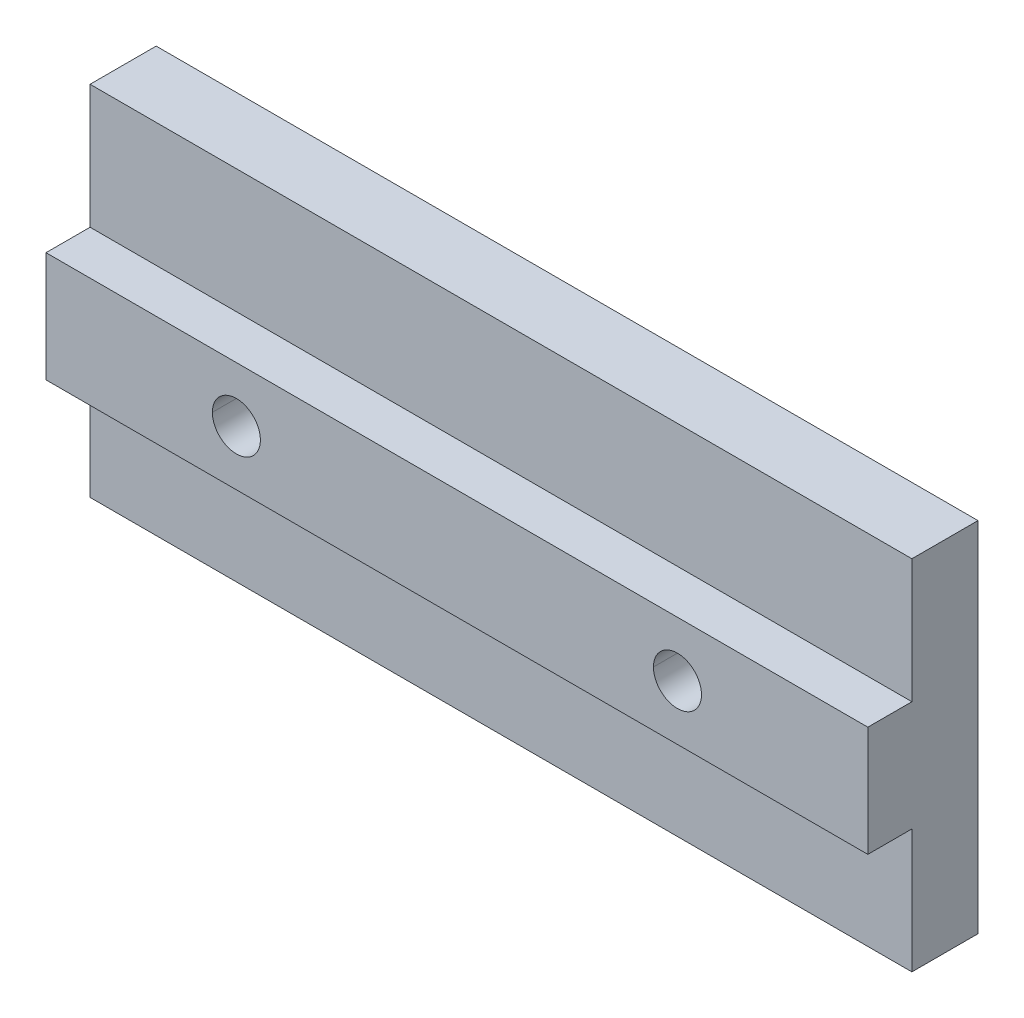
ISO-10303-21;
HEADER;
FILE_DESCRIPTION(('STEP AP214'),'2;1');
FILE_NAME('part.step','',(''),(''),'','','');
FILE_SCHEMA(('AUTOMOTIVE_DESIGN { 1 0 10303 214 1 1 1 1 }'));
ENDSEC;
DATA;
#1=APPLICATION_CONTEXT('core data for automotive mechanical design processes');
#2=APPLICATION_PROTOCOL_DEFINITION('international standard','automotive_design',2000,#1);
#3=PRODUCT_CONTEXT('',#1,'mechanical');
#4=PRODUCT('Part','Part','',(#3));
#5=PRODUCT_RELATED_PRODUCT_CATEGORY('part','',(#4));
#6=PRODUCT_DEFINITION_FORMATION('','',#4);
#7=PRODUCT_DEFINITION_CONTEXT('part definition',#1,'design');
#8=PRODUCT_DEFINITION('design','',#6,#7);
#9=PRODUCT_DEFINITION_SHAPE('','',#8);
#10=(LENGTH_UNIT() NAMED_UNIT(*) SI_UNIT(.MILLI.,.METRE.));
#11=(NAMED_UNIT(*) PLANE_ANGLE_UNIT() SI_UNIT($,.RADIAN.));
#12=(NAMED_UNIT(*) SI_UNIT($,.STERADIAN.) SOLID_ANGLE_UNIT());
#13=UNCERTAINTY_MEASURE_WITH_UNIT(LENGTH_MEASURE(1.E-05),#10,'distance_accuracy_value','');
#14=(GEOMETRIC_REPRESENTATION_CONTEXT(3) GLOBAL_UNCERTAINTY_ASSIGNED_CONTEXT((#13)) GLOBAL_UNIT_ASSIGNED_CONTEXT((#10,
#11,#12)) REPRESENTATION_CONTEXT('',''));
#15=CARTESIAN_POINT('',(0.,0.,0.));
#16=DIRECTION('',(0.,0.,1.));
#17=DIRECTION('',(1.,0.,0.));
#18=AXIS2_PLACEMENT_3D('',#15,#16,#17);
#19=CARTESIAN_POINT('',(23.6855,-10.3124,-3.81));
#20=DIRECTION('',(0.,0.,1.));
#21=DIRECTION('',(1.,0.,0.));
#22=AXIS2_PLACEMENT_3D('',#19,#20,#21);
#23=PLANE('',#22);
#24=CARTESIAN_POINT('',(12.7127,0.,-3.81));
#25=DIRECTION('',(0.,0.,-1.));
#26=DIRECTION('',(-1.,0.,0.));
#27=AXIS2_PLACEMENT_3D('',#24,#25,#26);
#28=CIRCLE('',#27,1.3843);
#29=CARTESIAN_POINT('',(11.3284,0.,-3.81));
#30=VERTEX_POINT('',#29);
#31=CARTESIAN_POINT('',(14.097,0.,-3.81));
#32=VERTEX_POINT('',#31);
#33=EDGE_CURVE('E11',#30,#32,#28,.T.);
#34=ORIENTED_EDGE('',*,*,#33,.F.);
#35=CARTESIAN_POINT('',(12.7127,0.,-3.81));
#36=DIRECTION('',(0.,0.,-1.));
#37=DIRECTION('',(-1.,0.,0.));
#38=AXIS2_PLACEMENT_3D('',#35,#36,#37);
#39=CIRCLE('',#38,1.3843);
#40=EDGE_CURVE('E25',#32,#30,#39,.T.);
#41=ORIENTED_EDGE('',*,*,#40,.F.);
#42=EDGE_LOOP('',(#34,#41));
#43=FACE_BOUND('',#42,.T.);
#44=CARTESIAN_POINT('',(-12.7127,0.,-3.81));
#45=DIRECTION('',(0.,0.,-1.));
#46=DIRECTION('',(-1.,0.,0.));
#47=AXIS2_PLACEMENT_3D('',#44,#45,#46);
#48=CIRCLE('',#47,1.3843);
#49=CARTESIAN_POINT('',(-14.097,0.,-3.81));
#50=VERTEX_POINT('',#49);
#51=CARTESIAN_POINT('',(-11.3284,0.,-3.81));
#52=VERTEX_POINT('',#51);
#53=EDGE_CURVE('E237',#50,#52,#48,.T.);
#54=ORIENTED_EDGE('',*,*,#53,.F.);
#55=CARTESIAN_POINT('',(-12.7127,0.,-3.81));
#56=DIRECTION('',(0.,0.,-1.));
#57=DIRECTION('',(-1.,0.,0.));
#58=AXIS2_PLACEMENT_3D('',#55,#56,#57);
#59=CIRCLE('',#58,1.3843);
#60=EDGE_CURVE('E232',#52,#50,#59,.T.);
#61=ORIENTED_EDGE('',*,*,#60,.F.);
#62=EDGE_LOOP('',(#54,#61));
#63=FACE_BOUND('',#62,.T.);
#64=DIRECTION('',(0.,1.,0.));
#65=VECTOR('',#64,1.);
#66=CARTESIAN_POINT('',(-23.6855,-10.3124,-3.81));
#67=LINE('',#66,#65);
#68=CARTESIAN_POINT('',(-23.6855,-10.3124,-3.81));
#69=VERTEX_POINT('',#68);
#70=CARTESIAN_POINT('',(-23.6855,10.3124,-3.81));
#71=VERTEX_POINT('',#70);
#72=EDGE_CURVE('E228',#69,#71,#67,.T.);
#73=ORIENTED_EDGE('',*,*,#72,.T.);
#74=DIRECTION('',(-1.,0.,0.));
#75=VECTOR('',#74,1.);
#76=CARTESIAN_POINT('',(23.6855,10.3124,-3.81));
#77=LINE('',#76,#75);
#78=CARTESIAN_POINT('',(23.6855,10.3124,-3.81));
#79=VERTEX_POINT('',#78);
#80=EDGE_CURVE('E118',#79,#71,#77,.T.);
#81=ORIENTED_EDGE('',*,*,#80,.F.);
#82=DIRECTION('',(0.,1.,0.));
#83=VECTOR('',#82,1.);
#84=CARTESIAN_POINT('',(23.6855,-10.3124,-3.81));
#85=LINE('',#84,#83);
#86=CARTESIAN_POINT('',(23.6855,-10.3124,-3.81));
#87=VERTEX_POINT('',#86);
#88=EDGE_CURVE('E220',#87,#79,#85,.T.);
#89=ORIENTED_EDGE('',*,*,#88,.F.);
#90=DIRECTION('',(-1.,0.,0.));
#91=VECTOR('',#90,1.);
#92=CARTESIAN_POINT('',(23.6855,-10.3124,-3.81));
#93=LINE('',#92,#91);
#94=EDGE_CURVE('E216',#87,#69,#93,.T.);
#95=ORIENTED_EDGE('',*,*,#94,.T.);
#96=EDGE_LOOP('',(#73,#81,#89,#95));
#97=FACE_BOUND('',#96,.T.);
#98=ADVANCED_FACE('F17',(#43,#63,#97),#23,.F.);
#99=CARTESIAN_POINT('',(23.6855,-10.3124,0.));
#100=DIRECTION('',(0.,1.,0.));
#101=DIRECTION('',(0.,0.,1.));
#102=AXIS2_PLACEMENT_3D('',#99,#100,#101);
#103=PLANE('',#102);
#104=DIRECTION('',(0.,0.,-1.));
#105=VECTOR('',#104,1.);
#106=CARTESIAN_POINT('',(-23.6855,-10.3124,0.));
#107=LINE('',#106,#105);
#108=CARTESIAN_POINT('',(-23.6855,-10.3124,0.));
#109=VERTEX_POINT('',#108);
#110=EDGE_CURVE('E211',#109,#69,#107,.T.);
#111=ORIENTED_EDGE('',*,*,#110,.T.);
#112=ORIENTED_EDGE('',*,*,#94,.F.);
#113=DIRECTION('',(0.,0.,-1.));
#114=VECTOR('',#113,1.);
#115=CARTESIAN_POINT('',(23.6855,-10.3124,0.));
#116=LINE('',#115,#114);
#117=CARTESIAN_POINT('',(23.6855,-10.3124,0.));
#118=VERTEX_POINT('',#117);
#119=EDGE_CURVE('E206',#118,#87,#116,.T.);
#120=ORIENTED_EDGE('',*,*,#119,.F.);
#121=DIRECTION('',(-1.,0.,0.));
#122=VECTOR('',#121,1.);
#123=CARTESIAN_POINT('',(23.6855,-10.3124,0.));
#124=LINE('',#123,#122);
#125=EDGE_CURVE('E202',#118,#109,#124,.T.);
#126=ORIENTED_EDGE('',*,*,#125,.T.);
#127=EDGE_LOOP('',(#111,#112,#120,#126));
#128=FACE_BOUND('',#127,.T.);
#129=ADVANCED_FACE('F385',(#128),#103,.F.);
#130=CARTESIAN_POINT('',(23.6855,-3.175,0.));
#131=DIRECTION('',(0.,0.,-1.));
#132=DIRECTION('',(-1.,0.,0.));
#133=AXIS2_PLACEMENT_3D('',#130,#131,#132);
#134=PLANE('',#133);
#135=DIRECTION('',(0.,-1.,0.));
#136=VECTOR('',#135,1.);
#137=CARTESIAN_POINT('',(-23.6855,-3.175,0.));
#138=LINE('',#137,#136);
#139=CARTESIAN_POINT('',(-23.6855,-3.175,0.));
#140=VERTEX_POINT('',#139);
#141=EDGE_CURVE('E197',#140,#109,#138,.T.);
#142=ORIENTED_EDGE('',*,*,#141,.T.);
#143=ORIENTED_EDGE('',*,*,#125,.F.);
#144=DIRECTION('',(0.,-1.,0.));
#145=VECTOR('',#144,1.);
#146=CARTESIAN_POINT('',(23.6855,-3.175,0.));
#147=LINE('',#146,#145);
#148=CARTESIAN_POINT('',(23.6855,-3.175,0.));
#149=VERTEX_POINT('',#148);
#150=EDGE_CURVE('E192',#149,#118,#147,.T.);
#151=ORIENTED_EDGE('',*,*,#150,.F.);
#152=DIRECTION('',(-1.,0.,0.));
#153=VECTOR('',#152,1.);
#154=CARTESIAN_POINT('',(23.6855,-3.175,0.));
#155=LINE('',#154,#153);
#156=EDGE_CURVE('E188',#149,#140,#155,.T.);
#157=ORIENTED_EDGE('',*,*,#156,.T.);
#158=EDGE_LOOP('',(#142,#143,#151,#157));
#159=FACE_BOUND('',#158,.T.);
#160=ADVANCED_FACE('F389',(#159),#134,.F.);
#161=CARTESIAN_POINT('',(23.6855,-3.175,2.54));
#162=DIRECTION('',(0.,1.,0.));
#163=DIRECTION('',(0.,0.,1.));
#164=AXIS2_PLACEMENT_3D('',#161,#162,#163);
#165=PLANE('',#164);
#166=DIRECTION('',(0.,0.,-1.));
#167=VECTOR('',#166,1.);
#168=CARTESIAN_POINT('',(-23.6855,-3.175,2.54));
#169=LINE('',#168,#167);
#170=CARTESIAN_POINT('',(-23.6855,-3.175,2.54));
#171=VERTEX_POINT('',#170);
#172=EDGE_CURVE('E183',#171,#140,#169,.T.);
#173=ORIENTED_EDGE('',*,*,#172,.T.);
#174=ORIENTED_EDGE('',*,*,#156,.F.);
#175=DIRECTION('',(0.,0.,-1.));
#176=VECTOR('',#175,1.);
#177=CARTESIAN_POINT('',(23.6855,-3.175,2.54));
#178=LINE('',#177,#176);
#179=CARTESIAN_POINT('',(23.6855,-3.175,2.54));
#180=VERTEX_POINT('',#179);
#181=EDGE_CURVE('E178',#180,#149,#178,.T.);
#182=ORIENTED_EDGE('',*,*,#181,.F.);
#183=DIRECTION('',(-1.,0.,0.));
#184=VECTOR('',#183,1.);
#185=CARTESIAN_POINT('',(23.6855,-3.175,2.54));
#186=LINE('',#185,#184);
#187=EDGE_CURVE('E174',#180,#171,#186,.T.);
#188=ORIENTED_EDGE('',*,*,#187,.T.);
#189=EDGE_LOOP('',(#173,#174,#182,#188));
#190=FACE_BOUND('',#189,.T.);
#191=ADVANCED_FACE('F365',(#190),#165,.F.);
#192=CARTESIAN_POINT('',(23.6855,3.175,2.54));
#193=DIRECTION('',(0.,0.,-1.));
#194=DIRECTION('',(-1.,0.,0.));
#195=AXIS2_PLACEMENT_3D('',#192,#193,#194);
#196=PLANE('',#195);
#197=CARTESIAN_POINT('',(12.7127,0.,2.54));
#198=DIRECTION('',(0.,0.,-1.));
#199=DIRECTION('',(-1.,0.,0.));
#200=AXIS2_PLACEMENT_3D('',#197,#198,#199);
#201=CIRCLE('',#200,1.3843);
#202=CARTESIAN_POINT('',(11.3284,0.,2.54));
#203=VERTEX_POINT('',#202);
#204=CARTESIAN_POINT('',(14.097,0.,2.54));
#205=VERTEX_POINT('',#204);
#206=EDGE_CURVE('E170',#203,#205,#201,.T.);
#207=ORIENTED_EDGE('',*,*,#206,.T.);
#208=CARTESIAN_POINT('',(12.7127,0.,2.54));
#209=DIRECTION('',(0.,0.,-1.));
#210=DIRECTION('',(-1.,0.,0.));
#211=AXIS2_PLACEMENT_3D('',#208,#209,#210);
#212=CIRCLE('',#211,1.3843);
#213=EDGE_CURVE('E166',#205,#203,#212,.T.);
#214=ORIENTED_EDGE('',*,*,#213,.T.);
#215=EDGE_LOOP('',(#207,#214));
#216=FACE_BOUND('',#215,.T.);
#217=CARTESIAN_POINT('',(-12.7127,0.,2.54));
#218=DIRECTION('',(0.,0.,-1.));
#219=DIRECTION('',(-1.,0.,0.));
#220=AXIS2_PLACEMENT_3D('',#217,#218,#219);
#221=CIRCLE('',#220,1.3843);
#222=CARTESIAN_POINT('',(-14.097,0.,2.54));
#223=VERTEX_POINT('',#222);
#224=CARTESIAN_POINT('',(-11.3284,0.,2.54));
#225=VERTEX_POINT('',#224);
#226=EDGE_CURVE('E162',#223,#225,#221,.T.);
#227=ORIENTED_EDGE('',*,*,#226,.T.);
#228=CARTESIAN_POINT('',(-12.7127,0.,2.54));
#229=DIRECTION('',(0.,0.,-1.));
#230=DIRECTION('',(-1.,0.,0.));
#231=AXIS2_PLACEMENT_3D('',#228,#229,#230);
#232=CIRCLE('',#231,1.3843);
#233=EDGE_CURVE('E158',#225,#223,#232,.T.);
#234=ORIENTED_EDGE('',*,*,#233,.T.);
#235=EDGE_LOOP('',(#227,#234));
#236=FACE_BOUND('',#235,.T.);
#237=DIRECTION('',(0.,-1.,0.));
#238=VECTOR('',#237,1.);
#239=CARTESIAN_POINT('',(-23.6855,3.175,2.54));
#240=LINE('',#239,#238);
#241=CARTESIAN_POINT('',(-23.6855,3.175,2.54));
#242=VERTEX_POINT('',#241);
#243=EDGE_CURVE('E153',#242,#171,#240,.T.);
#244=ORIENTED_EDGE('',*,*,#243,.T.);
#245=ORIENTED_EDGE('',*,*,#187,.F.);
#246=DIRECTION('',(0.,-1.,0.));
#247=VECTOR('',#246,1.);
#248=CARTESIAN_POINT('',(23.6855,3.175,2.54));
#249=LINE('',#248,#247);
#250=CARTESIAN_POINT('',(23.6855,3.175,2.54));
#251=VERTEX_POINT('',#250);
#252=EDGE_CURVE('E148',#251,#180,#249,.T.);
#253=ORIENTED_EDGE('',*,*,#252,.F.);
#254=DIRECTION('',(-1.,0.,0.));
#255=VECTOR('',#254,1.);
#256=CARTESIAN_POINT('',(23.6855,3.175,2.54));
#257=LINE('',#256,#255);
#258=EDGE_CURVE('E144',#251,#242,#257,.T.);
#259=ORIENTED_EDGE('',*,*,#258,.T.);
#260=EDGE_LOOP('',(#244,#245,#253,#259));
#261=FACE_BOUND('',#260,.T.);
#262=ADVANCED_FACE('F361',(#216,#236,#261),#196,.F.);
#263=CARTESIAN_POINT('',(23.6855,3.175,0.));
#264=DIRECTION('',(0.,-1.,0.));
#265=DIRECTION('',(0.,0.,-1.));
#266=AXIS2_PLACEMENT_3D('',#263,#264,#265);
#267=PLANE('',#266);
#268=DIRECTION('',(0.,0.,1.));
#269=VECTOR('',#268,1.);
#270=CARTESIAN_POINT('',(-23.6855,3.175,0.));
#271=LINE('',#270,#269);
#272=CARTESIAN_POINT('',(-23.6855,3.175,0.));
#273=VERTEX_POINT('',#272);
#274=EDGE_CURVE('E126',#273,#242,#271,.T.);
#275=ORIENTED_EDGE('',*,*,#274,.T.);
#276=ORIENTED_EDGE('',*,*,#258,.F.);
#277=DIRECTION('',(0.,0.,1.));
#278=VECTOR('',#277,1.);
#279=CARTESIAN_POINT('',(23.6855,3.175,0.));
#280=LINE('',#279,#278);
#281=CARTESIAN_POINT('',(23.6855,3.175,0.));
#282=VERTEX_POINT('',#281);
#283=EDGE_CURVE('E129',#282,#251,#280,.T.);
#284=ORIENTED_EDGE('',*,*,#283,.F.);
#285=DIRECTION('',(-1.,0.,0.));
#286=VECTOR('',#285,1.);
#287=CARTESIAN_POINT('',(23.6855,3.175,0.));
#288=LINE('',#287,#286);
#289=EDGE_CURVE('E127',#282,#273,#288,.T.);
#290=ORIENTED_EDGE('',*,*,#289,.T.);
#291=EDGE_LOOP('',(#275,#276,#284,#290));
#292=FACE_BOUND('',#291,.T.);
#293=ADVANCED_FACE('F364',(#292),#267,.F.);
#294=CARTESIAN_POINT('',(23.6855,10.3124,0.));
#295=DIRECTION('',(0.,0.,-1.));
#296=DIRECTION('',(-1.,0.,0.));
#297=AXIS2_PLACEMENT_3D('',#294,#295,#296);
#298=PLANE('',#297);
#299=DIRECTION('',(0.,-1.,0.));
#300=VECTOR('',#299,1.);
#301=CARTESIAN_POINT('',(-23.6855,10.3124,0.));
#302=LINE('',#301,#300);
#303=CARTESIAN_POINT('',(-23.6855,10.3124,0.));
#304=VERTEX_POINT('',#303);
#305=EDGE_CURVE('E106',#304,#273,#302,.T.);
#306=ORIENTED_EDGE('',*,*,#305,.T.);
#307=ORIENTED_EDGE('',*,*,#289,.F.);
#308=DIRECTION('',(0.,-1.,0.));
#309=VECTOR('',#308,1.);
#310=CARTESIAN_POINT('',(23.6855,10.3124,0.));
#311=LINE('',#310,#309);
#312=CARTESIAN_POINT('',(23.6855,10.3124,0.));
#313=VERTEX_POINT('',#312);
#314=EDGE_CURVE('E109',#313,#282,#311,.T.);
#315=ORIENTED_EDGE('',*,*,#314,.F.);
#316=DIRECTION('',(-1.,0.,0.));
#317=VECTOR('',#316,1.);
#318=CARTESIAN_POINT('',(23.6855,10.3124,0.));
#319=LINE('',#318,#317);
#320=EDGE_CURVE('E101',#313,#304,#319,.T.);
#321=ORIENTED_EDGE('',*,*,#320,.T.);
#322=EDGE_LOOP('',(#306,#307,#315,#321));
#323=FACE_BOUND('',#322,.T.);
#324=ADVANCED_FACE('F103',(#323),#298,.F.);
#325=CARTESIAN_POINT('',(23.6855,10.3124,-3.81));
#326=DIRECTION('',(0.,-1.,0.));
#327=DIRECTION('',(0.,0.,-1.));
#328=AXIS2_PLACEMENT_3D('',#325,#326,#327);
#329=PLANE('',#328);
#330=DIRECTION('',(0.,0.,1.));
#331=VECTOR('',#330,1.);
#332=CARTESIAN_POINT('',(-23.6855,10.3124,-3.81));
#333=LINE('',#332,#331);
#334=EDGE_CURVE('E113',#71,#304,#333,.T.);
#335=ORIENTED_EDGE('',*,*,#334,.T.);
#336=ORIENTED_EDGE('',*,*,#320,.F.);
#337=DIRECTION('',(0.,0.,1.));
#338=VECTOR('',#337,1.);
#339=CARTESIAN_POINT('',(23.6855,10.3124,-3.81));
#340=LINE('',#339,#338);
#341=EDGE_CURVE('E121',#79,#313,#340,.T.);
#342=ORIENTED_EDGE('',*,*,#341,.F.);
#343=ORIENTED_EDGE('',*,*,#80,.T.);
#344=EDGE_LOOP('',(#335,#336,#342,#343));
#345=FACE_BOUND('',#344,.T.);
#346=ADVANCED_FACE('F117',(#345),#329,.F.);
#347=CARTESIAN_POINT('',(23.6855,0.,0.));
#348=DIRECTION('',(1.,0.,0.));
#349=DIRECTION('',(0.,0.,-1.));
#350=AXIS2_PLACEMENT_3D('',#347,#348,#349);
#351=PLANE('',#350);
#352=ORIENTED_EDGE('',*,*,#252,.T.);
#353=ORIENTED_EDGE('',*,*,#181,.T.);
#354=ORIENTED_EDGE('',*,*,#150,.T.);
#355=ORIENTED_EDGE('',*,*,#119,.T.);
#356=ORIENTED_EDGE('',*,*,#88,.T.);
#357=ORIENTED_EDGE('',*,*,#341,.T.);
#358=ORIENTED_EDGE('',*,*,#314,.T.);
#359=ORIENTED_EDGE('',*,*,#283,.T.);
#360=EDGE_LOOP('',(#352,#353,#354,#355,#356,#357,#358,#359));
#361=FACE_BOUND('',#360,.T.);
#362=ADVANCED_FACE('F375',(#361),#351,.T.);
#363=CARTESIAN_POINT('',(-23.6855,0.,0.));
#364=DIRECTION('',(1.,0.,0.));
#365=DIRECTION('',(0.,0.,-1.));
#366=AXIS2_PLACEMENT_3D('',#363,#364,#365);
#367=PLANE('',#366);
#368=ORIENTED_EDGE('',*,*,#243,.F.);
#369=ORIENTED_EDGE('',*,*,#274,.F.);
#370=ORIENTED_EDGE('',*,*,#305,.F.);
#371=ORIENTED_EDGE('',*,*,#334,.F.);
#372=ORIENTED_EDGE('',*,*,#72,.F.);
#373=ORIENTED_EDGE('',*,*,#110,.F.);
#374=ORIENTED_EDGE('',*,*,#141,.F.);
#375=ORIENTED_EDGE('',*,*,#172,.F.);
#376=EDGE_LOOP('',(#368,#369,#370,#371,#372,#373,#374,#375));
#377=FACE_BOUND('',#376,.T.);
#378=ADVANCED_FACE('F124',(#377),#367,.F.);
#379=CARTESIAN_POINT('',(-12.7127,0.,-3.81));
#380=DIRECTION('',(0.,0.,1.));
#381=DIRECTION('',(0.,1.,0.));
#382=AXIS2_PLACEMENT_3D('',#379,#380,#381);
#383=CYLINDRICAL_SURFACE('',#382,1.3843);
#384=ORIENTED_EDGE('',*,*,#233,.F.);
#385=CARTESIAN_POINT('',(-11.3284,0.,-3.81));
#386=DIRECTION('',(0.,0.,1.));
#387=VECTOR('',#386,1.);
#388=LINE('',#385,#387);
#389=EDGE_CURVE('E326',#52,#225,#388,.T.);
#390=ORIENTED_EDGE('',*,*,#389,.F.);
#391=ORIENTED_EDGE('',*,*,#60,.T.);
#392=CARTESIAN_POINT('',(-14.097,0.,-3.81));
#393=DIRECTION('',(0.,0.,1.));
#394=VECTOR('',#393,1.);
#395=LINE('',#392,#394);
#396=EDGE_CURVE('E314',#50,#223,#395,.T.);
#397=ORIENTED_EDGE('',*,*,#396,.T.);
#398=EDGE_LOOP('',(#384,#390,#391,#397));
#399=FACE_BOUND('',#398,.T.);
#400=ADVANCED_FACE('F331',(#399),#383,.F.);
#401=CARTESIAN_POINT('',(-12.7127,0.,-3.81));
#402=DIRECTION('',(0.,0.,1.));
#403=DIRECTION('',(0.,-1.,0.));
#404=AXIS2_PLACEMENT_3D('',#401,#402,#403);
#405=CYLINDRICAL_SURFACE('',#404,1.3843);
#406=ORIENTED_EDGE('',*,*,#53,.T.);
#407=ORIENTED_EDGE('',*,*,#389,.T.);
#408=ORIENTED_EDGE('',*,*,#226,.F.);
#409=ORIENTED_EDGE('',*,*,#396,.F.);
#410=EDGE_LOOP('',(#406,#407,#408,#409));
#411=FACE_BOUND('',#410,.T.);
#412=ADVANCED_FACE('F281',(#411),#405,.F.);
#413=CARTESIAN_POINT('',(12.7127,0.,-3.81));
#414=DIRECTION('',(0.,0.,1.));
#415=DIRECTION('',(0.,1.,0.));
#416=AXIS2_PLACEMENT_3D('',#413,#414,#415);
#417=CYLINDRICAL_SURFACE('',#416,1.3843);
#418=ORIENTED_EDGE('',*,*,#213,.F.);
#419=CARTESIAN_POINT('',(14.097,0.,-3.81));
#420=DIRECTION('',(0.,0.,1.));
#421=VECTOR('',#420,1.);
#422=LINE('',#419,#421);
#423=EDGE_CURVE('E255',#32,#205,#422,.T.);
#424=ORIENTED_EDGE('',*,*,#423,.F.);
#425=ORIENTED_EDGE('',*,*,#40,.T.);
#426=CARTESIAN_POINT('',(11.3284,0.,-3.81));
#427=DIRECTION('',(0.,0.,1.));
#428=VECTOR('',#427,1.);
#429=LINE('',#426,#428);
#430=EDGE_CURVE('E251',#30,#203,#429,.T.);
#431=ORIENTED_EDGE('',*,*,#430,.T.);
#432=EDGE_LOOP('',(#418,#424,#425,#431));
#433=FACE_BOUND('',#432,.T.);
#434=ADVANCED_FACE('F250',(#433),#417,.F.);
#435=CARTESIAN_POINT('',(12.7127,0.,-3.81));
#436=DIRECTION('',(0.,0.,1.));
#437=DIRECTION('',(0.,-1.,0.));
#438=AXIS2_PLACEMENT_3D('',#435,#436,#437);
#439=CYLINDRICAL_SURFACE('',#438,1.3843);
#440=ORIENTED_EDGE('',*,*,#33,.T.);
#441=ORIENTED_EDGE('',*,*,#423,.T.);
#442=ORIENTED_EDGE('',*,*,#206,.F.);
#443=ORIENTED_EDGE('',*,*,#430,.F.);
#444=EDGE_LOOP('',(#440,#441,#442,#443));
#445=FACE_BOUND('',#444,.T.);
#446=ADVANCED_FACE('F259',(#445),#439,.F.);
#447=CLOSED_SHELL('',(#98,#129,#160,#191,#262,#293,#324,#346,#362,#378,#400,#412,#434,#446));
#448=MANIFOLD_SOLID_BREP('B1',#447);
#449=ADVANCED_BREP_SHAPE_REPRESENTATION('',(#18,#448),#14);
#450=SHAPE_DEFINITION_REPRESENTATION(#9,#449);
ENDSEC;
END-ISO-10303-21;
